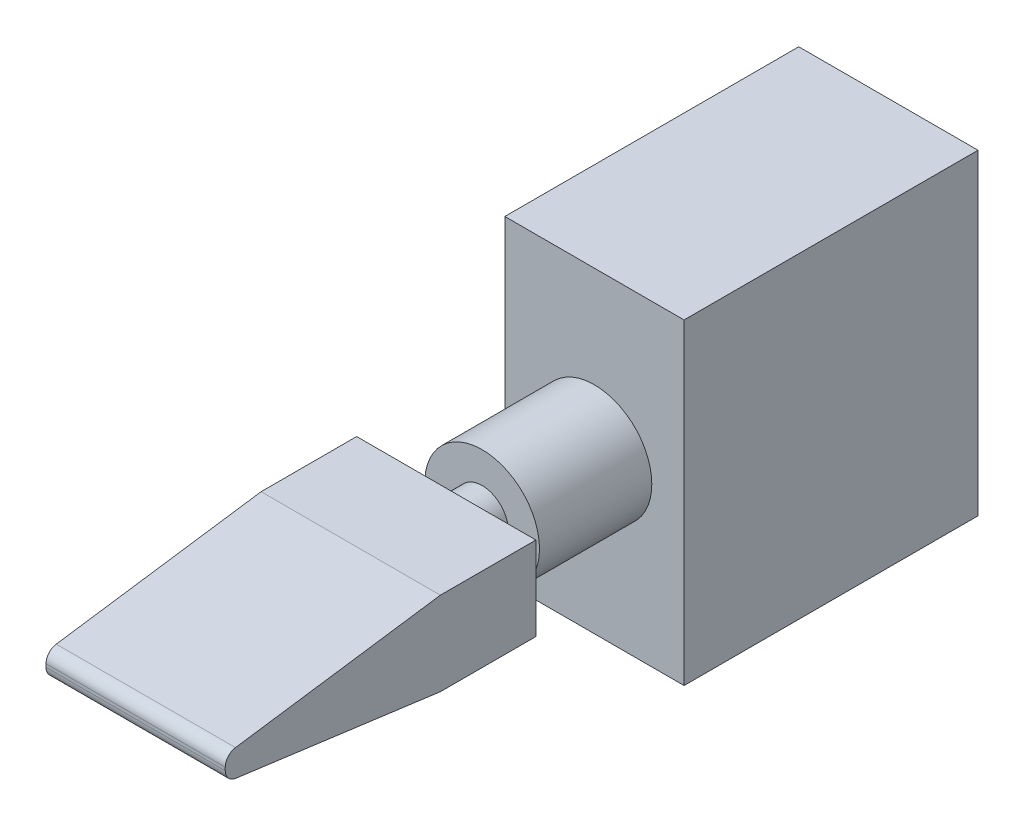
ISO-10303-21;
HEADER;
FILE_DESCRIPTION(('STEP AP214'),'2;1');
FILE_NAME('part.step','',(''),(''),'','','');
FILE_SCHEMA(('AUTOMOTIVE_DESIGN { 1 0 10303 214 1 1 1 1 }'));
ENDSEC;
DATA;
#1=APPLICATION_CONTEXT('core data for automotive mechanical design processes');
#2=APPLICATION_PROTOCOL_DEFINITION('international standard','automotive_design',2000,#1);
#3=PRODUCT_CONTEXT('',#1,'mechanical');
#4=PRODUCT('Part','Part','',(#3));
#5=PRODUCT_RELATED_PRODUCT_CATEGORY('part','',(#4));
#6=PRODUCT_DEFINITION_FORMATION('','',#4);
#7=PRODUCT_DEFINITION_CONTEXT('part definition',#1,'design');
#8=PRODUCT_DEFINITION('design','',#6,#7);
#9=PRODUCT_DEFINITION_SHAPE('','',#8);
#10=(LENGTH_UNIT() NAMED_UNIT(*) SI_UNIT(.MILLI.,.METRE.));
#11=(NAMED_UNIT(*) PLANE_ANGLE_UNIT() SI_UNIT($,.RADIAN.));
#12=(NAMED_UNIT(*) SI_UNIT($,.STERADIAN.) SOLID_ANGLE_UNIT());
#13=UNCERTAINTY_MEASURE_WITH_UNIT(LENGTH_MEASURE(1.E-05),#10,'distance_accuracy_value','');
#14=(GEOMETRIC_REPRESENTATION_CONTEXT(3) GLOBAL_UNCERTAINTY_ASSIGNED_CONTEXT((#13)) GLOBAL_UNIT_ASSIGNED_CONTEXT((#10,
#11,#12)) REPRESENTATION_CONTEXT('',''));
#15=CARTESIAN_POINT('',(0.,0.,0.));
#16=DIRECTION('',(0.,0.,1.));
#17=DIRECTION('',(1.,0.,0.));
#18=AXIS2_PLACEMENT_3D('',#15,#16,#17);
#19=CARTESIAN_POINT('',(9.525,-4.445,80.01));
#20=DIRECTION('',(-1.,0.,0.));
#21=DIRECTION('',(0.,0.,1.));
#22=AXIS2_PLACEMENT_3D('',#19,#20,#21);
#23=PLANE('',#22);
#24=DIRECTION('',(0.,0.,-1.));
#25=VECTOR('',#24,1.);
#26=CARTESIAN_POINT('',(9.525,4.445,80.01));
#27=LINE('',#26,#25);
#28=CARTESIAN_POINT('',(9.525,4.445,57.15));
#29=VERTEX_POINT('',#28);
#30=CARTESIAN_POINT('',(9.525,4.445,46.99));
#31=VERTEX_POINT('',#30);
#32=EDGE_CURVE('E175',#29,#31,#27,.T.);
#33=ORIENTED_EDGE('',*,*,#32,.F.);
#34=DIRECTION('',(0.,0.142868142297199,-0.989741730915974));
#35=VECTOR('',#34,1.);
#36=CARTESIAN_POINT('',(9.525,12.4354281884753,1.79504053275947));
#37=LINE('',#36,#35);
#38=CARTESIAN_POINT('',(9.525,1.30231595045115,78.9214425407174));
#39=VERTEX_POINT('',#38);
#40=EDGE_CURVE('E146',#39,#29,#37,.T.);
#41=ORIENTED_EDGE('',*,*,#40,.F.);
#42=CARTESIAN_POINT('',(9.525,0.04534395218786,78.74));
#43=DIRECTION('',(1.,0.,0.));
#44=DIRECTION('',(0.,0.,-1.));
#45=AXIS2_PLACEMENT_3D('',#42,#43,#44);
#46=CIRCLE('',#45,1.27);
#47=CARTESIAN_POINT('',(9.525,0.0453439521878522,80.01));
#48=VERTEX_POINT('',#47);
#49=EDGE_CURVE('E135',#48,#39,#46,.F.);
#50=ORIENTED_EDGE('',*,*,#49,.F.);
#51=DIRECTION('',(0.,1.,0.));
#52=VECTOR('',#51,1.);
#53=CARTESIAN_POINT('',(9.525,-4.445,80.01));
#54=LINE('',#53,#52);
#55=CARTESIAN_POINT('',(9.525,-0.28301559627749,80.01));
#56=VERTEX_POINT('',#55);
#57=EDGE_CURVE('E145',#56,#48,#54,.T.);
#58=ORIENTED_EDGE('',*,*,#57,.F.);
#59=CARTESIAN_POINT('',(9.525,-0.283015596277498,78.74));
#60=DIRECTION('',(1.,0.,0.));
#61=DIRECTION('',(0.,0.,-1.));
#62=AXIS2_PLACEMENT_3D('',#59,#60,#61);
#63=CIRCLE('',#62,1.27);
#64=CARTESIAN_POINT('',(9.525,-1.54185927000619,78.9079660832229));
#65=VERTEX_POINT('',#64);
#66=EDGE_CURVE('E68',#56,#65,#63,.T.);
#67=ORIENTED_EDGE('',*,*,#66,.T.);
#68=DIRECTION('',(0.,0.132256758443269,0.991215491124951));
#69=VECTOR('',#68,1.);
#70=CARTESIAN_POINT('',(9.525,-11.8593249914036,1.58237627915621));
#71=LINE('',#70,#69);
#72=CARTESIAN_POINT('',(9.525,-4.445,57.15));
#73=VERTEX_POINT('',#72);
#74=EDGE_CURVE('E435',#73,#65,#71,.T.);
#75=ORIENTED_EDGE('',*,*,#74,.F.);
#76=DIRECTION('',(0.,0.,-1.));
#77=VECTOR('',#76,1.);
#78=CARTESIAN_POINT('',(9.525,-4.445,80.01));
#79=LINE('',#78,#77);
#80=CARTESIAN_POINT('',(9.525,-4.445,46.99));
#81=VERTEX_POINT('',#80);
#82=EDGE_CURVE('E153',#73,#81,#79,.T.);
#83=ORIENTED_EDGE('',*,*,#82,.T.);
#84=DIRECTION('',(0.,1.,0.));
#85=VECTOR('',#84,1.);
#86=CARTESIAN_POINT('',(9.525,-4.445,46.99));
#87=LINE('',#86,#85);
#88=EDGE_CURVE('E162',#81,#31,#87,.T.);
#89=ORIENTED_EDGE('',*,*,#88,.T.);
#90=EDGE_LOOP('',(#33,#41,#50,#58,#67,#75,#83,#89));
#91=FACE_BOUND('',#90,.T.);
#92=ADVANCED_FACE('F45',(#91),#23,.F.);
#93=CARTESIAN_POINT('',(-9.525,-4.445,80.01));
#94=DIRECTION('',(1.,0.,0.));
#95=DIRECTION('',(0.,0.,-1.));
#96=AXIS2_PLACEMENT_3D('',#93,#94,#95);
#97=PLANE('',#96);
#98=CARTESIAN_POINT('',(-9.525,0.04534395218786,78.74));
#99=DIRECTION('',(1.,0.,0.));
#100=DIRECTION('',(0.,0.,-1.));
#101=AXIS2_PLACEMENT_3D('',#98,#99,#100);
#102=CIRCLE('',#101,1.27);
#103=CARTESIAN_POINT('',(-9.525,0.0453439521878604,80.01));
#104=VERTEX_POINT('',#103);
#105=CARTESIAN_POINT('',(-9.525,1.30231595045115,78.9214425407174));
#106=VERTEX_POINT('',#105);
#107=EDGE_CURVE('E60',#104,#106,#102,.F.);
#108=ORIENTED_EDGE('',*,*,#107,.T.);
#109=DIRECTION('',(0.,0.142868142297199,-0.989741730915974));
#110=VECTOR('',#109,1.);
#111=CARTESIAN_POINT('',(-9.525,1.03108091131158,80.8004663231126));
#112=LINE('',#111,#110);
#113=CARTESIAN_POINT('',(-9.525,4.445,57.15));
#114=VERTEX_POINT('',#113);
#115=EDGE_CURVE('E11',#106,#114,#112,.T.);
#116=ORIENTED_EDGE('',*,*,#115,.T.);
#117=DIRECTION('',(0.,0.,-1.));
#118=VECTOR('',#117,1.);
#119=CARTESIAN_POINT('',(-9.525,4.445,80.01));
#120=LINE('',#119,#118);
#121=CARTESIAN_POINT('',(-9.525,4.445,46.99));
#122=VERTEX_POINT('',#121);
#123=EDGE_CURVE('E173',#114,#122,#120,.T.);
#124=ORIENTED_EDGE('',*,*,#123,.T.);
#125=DIRECTION('',(0.,-1.,0.));
#126=VECTOR('',#125,1.);
#127=CARTESIAN_POINT('',(-9.525,-4.445,46.99));
#128=LINE('',#127,#126);
#129=CARTESIAN_POINT('',(-9.525,-4.445,46.99));
#130=VERTEX_POINT('',#129);
#131=EDGE_CURVE('E156',#122,#130,#128,.T.);
#132=ORIENTED_EDGE('',*,*,#131,.T.);
#133=DIRECTION('',(0.,0.,-1.));
#134=VECTOR('',#133,1.);
#135=CARTESIAN_POINT('',(-9.525,-4.445,80.01));
#136=LINE('',#135,#134);
#137=CARTESIAN_POINT('',(-9.525,-4.445,57.15));
#138=VERTEX_POINT('',#137);
#139=EDGE_CURVE('E171',#138,#130,#136,.T.);
#140=ORIENTED_EDGE('',*,*,#139,.F.);
#141=DIRECTION('',(0.,0.132256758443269,0.991215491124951));
#142=VECTOR('',#141,1.);
#143=CARTESIAN_POINT('',(-9.525,-1.44816949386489,79.6101363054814));
#144=LINE('',#143,#142);
#145=CARTESIAN_POINT('',(-9.525,-1.54185927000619,78.9079660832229));
#146=VERTEX_POINT('',#145);
#147=EDGE_CURVE('E159',#138,#146,#144,.T.);
#148=ORIENTED_EDGE('',*,*,#147,.T.);
#149=CARTESIAN_POINT('',(-9.525,-0.283015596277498,78.74));
#150=DIRECTION('',(1.,0.,0.));
#151=DIRECTION('',(0.,0.,-1.));
#152=AXIS2_PLACEMENT_3D('',#149,#150,#151);
#153=CIRCLE('',#152,1.27);
#154=CARTESIAN_POINT('',(-9.525,-0.28301559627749,80.01));
#155=VERTEX_POINT('',#154);
#156=EDGE_CURVE('E430',#155,#146,#153,.T.);
#157=ORIENTED_EDGE('',*,*,#156,.F.);
#158=DIRECTION('',(0.,-1.,0.));
#159=VECTOR('',#158,1.);
#160=CARTESIAN_POINT('',(-9.525,-4.445,80.01));
#161=LINE('',#160,#159);
#162=EDGE_CURVE('E150',#104,#155,#161,.T.);
#163=ORIENTED_EDGE('',*,*,#162,.F.);
#164=EDGE_LOOP('',(#108,#116,#124,#132,#140,#148,#157,#163));
#165=FACE_BOUND('',#164,.T.);
#166=ADVANCED_FACE('F254',(#165),#97,.F.);
#167=CARTESIAN_POINT('',(9.525,-16.8275,31.242));
#168=DIRECTION('',(-1.,0.,0.));
#169=DIRECTION('',(0.,0.,1.));
#170=AXIS2_PLACEMENT_3D('',#167,#168,#169);
#171=PLANE('',#170);
#172=DIRECTION('',(0.,1.,0.));
#173=VECTOR('',#172,1.);
#174=CARTESIAN_POINT('',(9.525,-16.8275,0.));
#175=LINE('',#174,#173);
#176=CARTESIAN_POINT('',(9.525,-16.8275,0.));
#177=VERTEX_POINT('',#176);
#178=CARTESIAN_POINT('',(9.525,16.8275,0.));
#179=VERTEX_POINT('',#178);
#180=EDGE_CURVE('E187',#177,#179,#175,.T.);
#181=ORIENTED_EDGE('',*,*,#180,.T.);
#182=DIRECTION('',(0.,0.,-1.));
#183=VECTOR('',#182,1.);
#184=CARTESIAN_POINT('',(9.525,16.8275,31.242));
#185=LINE('',#184,#183);
#186=CARTESIAN_POINT('',(9.525,16.8275,31.242));
#187=VERTEX_POINT('',#186);
#188=EDGE_CURVE('E190',#187,#179,#185,.T.);
#189=ORIENTED_EDGE('',*,*,#188,.F.);
#190=DIRECTION('',(0.,1.,0.));
#191=VECTOR('',#190,1.);
#192=CARTESIAN_POINT('',(9.525,-16.8275,31.242));
#193=LINE('',#192,#191);
#194=CARTESIAN_POINT('',(9.525,-16.8275,31.242));
#195=VERTEX_POINT('',#194);
#196=EDGE_CURVE('E191',#195,#187,#193,.T.);
#197=ORIENTED_EDGE('',*,*,#196,.F.);
#198=DIRECTION('',(0.,0.,-1.));
#199=VECTOR('',#198,1.);
#200=CARTESIAN_POINT('',(9.525,-16.8275,31.242));
#201=LINE('',#200,#199);
#202=EDGE_CURVE('E201',#195,#177,#201,.T.);
#203=ORIENTED_EDGE('',*,*,#202,.T.);
#204=EDGE_LOOP('',(#181,#189,#197,#203));
#205=FACE_BOUND('',#204,.T.);
#206=ADVANCED_FACE('F47',(#205),#171,.F.);
#207=CARTESIAN_POINT('',(-9.525,16.8275,31.242));
#208=DIRECTION('',(0.,-1.,0.));
#209=DIRECTION('',(0.,0.,-1.));
#210=AXIS2_PLACEMENT_3D('',#207,#208,#209);
#211=PLANE('',#210);
#212=DIRECTION('',(-1.,0.,0.));
#213=VECTOR('',#212,1.);
#214=CARTESIAN_POINT('',(-9.525,16.8275,0.));
#215=LINE('',#214,#213);
#216=CARTESIAN_POINT('',(-9.525,16.8275,0.));
#217=VERTEX_POINT('',#216);
#218=EDGE_CURVE('E204',#179,#217,#215,.T.);
#219=ORIENTED_EDGE('',*,*,#218,.T.);
#220=DIRECTION('',(0.,0.,-1.));
#221=VECTOR('',#220,1.);
#222=CARTESIAN_POINT('',(-9.525,16.8275,31.242));
#223=LINE('',#222,#221);
#224=CARTESIAN_POINT('',(-9.525,16.8275,31.242));
#225=VERTEX_POINT('',#224);
#226=EDGE_CURVE('E214',#225,#217,#223,.T.);
#227=ORIENTED_EDGE('',*,*,#226,.F.);
#228=DIRECTION('',(-1.,0.,0.));
#229=VECTOR('',#228,1.);
#230=CARTESIAN_POINT('',(-9.525,16.8275,31.242));
#231=LINE('',#230,#229);
#232=EDGE_CURVE('E194',#187,#225,#231,.T.);
#233=ORIENTED_EDGE('',*,*,#232,.F.);
#234=ORIENTED_EDGE('',*,*,#188,.T.);
#235=EDGE_LOOP('',(#219,#227,#233,#234));
#236=FACE_BOUND('',#235,.T.);
#237=ADVANCED_FACE('F221',(#236),#211,.F.);
#238=CARTESIAN_POINT('',(-9.525,-16.8275,31.242));
#239=DIRECTION('',(1.,0.,0.));
#240=DIRECTION('',(0.,0.,-1.));
#241=AXIS2_PLACEMENT_3D('',#238,#239,#240);
#242=PLANE('',#241);
#243=DIRECTION('',(0.,-1.,0.));
#244=VECTOR('',#243,1.);
#245=CARTESIAN_POINT('',(-9.525,-16.8275,0.));
#246=LINE('',#245,#244);
#247=CARTESIAN_POINT('',(-9.525,-16.8275,0.));
#248=VERTEX_POINT('',#247);
#249=EDGE_CURVE('E206',#217,#248,#246,.T.);
#250=ORIENTED_EDGE('',*,*,#249,.T.);
#251=DIRECTION('',(0.,0.,-1.));
#252=VECTOR('',#251,1.);
#253=CARTESIAN_POINT('',(-9.525,-16.8275,31.242));
#254=LINE('',#253,#252);
#255=CARTESIAN_POINT('',(-9.525,-16.8275,31.242));
#256=VERTEX_POINT('',#255);
#257=EDGE_CURVE('E211',#256,#248,#254,.T.);
#258=ORIENTED_EDGE('',*,*,#257,.F.);
#259=DIRECTION('',(0.,-1.,0.));
#260=VECTOR('',#259,1.);
#261=CARTESIAN_POINT('',(-9.525,-16.8275,31.242));
#262=LINE('',#261,#260);
#263=EDGE_CURVE('E197',#225,#256,#262,.T.);
#264=ORIENTED_EDGE('',*,*,#263,.F.);
#265=ORIENTED_EDGE('',*,*,#226,.T.);
#266=EDGE_LOOP('',(#250,#258,#264,#265));
#267=FACE_BOUND('',#266,.T.);
#268=ADVANCED_FACE('F233',(#267),#242,.F.);
#269=CARTESIAN_POINT('',(-9.525,-16.8275,31.242));
#270=DIRECTION('',(0.,1.,0.));
#271=DIRECTION('',(0.,0.,1.));
#272=AXIS2_PLACEMENT_3D('',#269,#270,#271);
#273=PLANE('',#272);
#274=DIRECTION('',(1.,0.,0.));
#275=VECTOR('',#274,1.);
#276=CARTESIAN_POINT('',(-9.525,-16.8275,0.));
#277=LINE('',#276,#275);
#278=EDGE_CURVE('E195',#248,#177,#277,.T.);
#279=ORIENTED_EDGE('',*,*,#278,.T.);
#280=ORIENTED_EDGE('',*,*,#202,.F.);
#281=DIRECTION('',(1.,0.,0.));
#282=VECTOR('',#281,1.);
#283=CARTESIAN_POINT('',(-9.525,-16.8275,31.242));
#284=LINE('',#283,#282);
#285=EDGE_CURVE('E199',#256,#195,#284,.T.);
#286=ORIENTED_EDGE('',*,*,#285,.F.);
#287=ORIENTED_EDGE('',*,*,#257,.T.);
#288=EDGE_LOOP('',(#279,#280,#286,#287));
#289=FACE_BOUND('',#288,.T.);
#290=ADVANCED_FACE('F237',(#289),#273,.F.);
#291=CARTESIAN_POINT('',(0.,0.,31.242));
#292=DIRECTION('',(0.,0.,-1.));
#293=DIRECTION('',(-1.,0.,0.));
#294=AXIS2_PLACEMENT_3D('',#291,#292,#293);
#295=PLANE('',#294);
#296=CARTESIAN_POINT('',(0.,0.,31.242));
#297=DIRECTION('',(0.,0.,1.));
#298=DIRECTION('',(1.,0.,0.));
#299=AXIS2_PLACEMENT_3D('',#296,#297,#298);
#300=CIRCLE('',#299,6.096);
#301=CARTESIAN_POINT('',(6.096,0.,31.242));
#302=VERTEX_POINT('',#301);
#303=EDGE_CURVE('E184',#302,#302,#300,.T.);
#304=ORIENTED_EDGE('',*,*,#303,.F.);
#305=EDGE_LOOP('',(#304));
#306=FACE_BOUND('',#305,.T.);
#307=ORIENTED_EDGE('',*,*,#196,.T.);
#308=ORIENTED_EDGE('',*,*,#232,.T.);
#309=ORIENTED_EDGE('',*,*,#263,.T.);
#310=ORIENTED_EDGE('',*,*,#285,.T.);
#311=EDGE_LOOP('',(#307,#308,#309,#310));
#312=FACE_BOUND('',#311,.T.);
#313=ADVANCED_FACE('F239',(#306,#312),#295,.F.);
#314=CARTESIAN_POINT('',(0.,0.,0.));
#315=DIRECTION('',(0.,0.,-1.));
#316=DIRECTION('',(-1.,0.,0.));
#317=AXIS2_PLACEMENT_3D('',#314,#315,#316);
#318=PLANE('',#317);
#319=ORIENTED_EDGE('',*,*,#180,.F.);
#320=ORIENTED_EDGE('',*,*,#278,.F.);
#321=ORIENTED_EDGE('',*,*,#249,.F.);
#322=ORIENTED_EDGE('',*,*,#218,.F.);
#323=EDGE_LOOP('',(#319,#320,#321,#322));
#324=FACE_BOUND('',#323,.T.);
#325=ADVANCED_FACE('F229',(#324),#318,.T.);
#326=CARTESIAN_POINT('',(0.,0.,43.18));
#327=DIRECTION('',(0.,0.,-1.));
#328=DIRECTION('',(-1.,0.,0.));
#329=AXIS2_PLACEMENT_3D('',#326,#327,#328);
#330=CYLINDRICAL_SURFACE('',#329,6.096);
#331=CARTESIAN_POINT('',(0.,0.,43.18));
#332=DIRECTION('',(0.,0.,1.));
#333=DIRECTION('',(1.,0.,0.));
#334=AXIS2_PLACEMENT_3D('',#331,#332,#333);
#335=CIRCLE('',#334,6.096);
#336=CARTESIAN_POINT('',(6.096,0.,43.18));
#337=VERTEX_POINT('',#336);
#338=EDGE_CURVE('E180',#337,#337,#335,.T.);
#339=ORIENTED_EDGE('',*,*,#338,.F.);
#340=EDGE_LOOP('',(#339));
#341=FACE_BOUND('',#340,.T.);
#342=ORIENTED_EDGE('',*,*,#303,.T.);
#343=EDGE_LOOP('',(#342));
#344=FACE_BOUND('',#343,.T.);
#345=ADVANCED_FACE('F247',(#341,#344),#330,.T.);
#346=CARTESIAN_POINT('',(0.,0.,43.18));
#347=DIRECTION('',(0.,0.,1.));
#348=DIRECTION('',(1.,0.,0.));
#349=AXIS2_PLACEMENT_3D('',#346,#347,#348);
#350=PLANE('',#349);
#351=CARTESIAN_POINT('',(0.,0.,43.18));
#352=DIRECTION('',(0.,0.,1.));
#353=DIRECTION('',(1.,0.,0.));
#354=AXIS2_PLACEMENT_3D('',#351,#352,#353);
#355=CIRCLE('',#354,2.794);
#356=CARTESIAN_POINT('',(-2.794,0.,43.18));
#357=VERTEX_POINT('',#356);
#358=EDGE_CURVE('E181',#357,#357,#355,.T.);
#359=ORIENTED_EDGE('',*,*,#358,.F.);
#360=EDGE_LOOP('',(#359));
#361=FACE_BOUND('',#360,.T.);
#362=ORIENTED_EDGE('',*,*,#338,.T.);
#363=EDGE_LOOP('',(#362));
#364=FACE_BOUND('',#363,.T.);
#365=ADVANCED_FACE('F267',(#361,#364),#350,.T.);
#366=CARTESIAN_POINT('',(0.,0.,46.99));
#367=DIRECTION('',(0.,0.,-1.));
#368=DIRECTION('',(-1.,0.,0.));
#369=AXIS2_PLACEMENT_3D('',#366,#367,#368);
#370=CYLINDRICAL_SURFACE('',#369,2.794);
#371=CARTESIAN_POINT('',(0.,0.,46.99));
#372=DIRECTION('',(0.,0.,1.));
#373=DIRECTION('',(1.,0.,0.));
#374=AXIS2_PLACEMENT_3D('',#371,#372,#373);
#375=CIRCLE('',#374,2.794);
#376=CARTESIAN_POINT('',(-2.794,0.,46.99));
#377=VERTEX_POINT('',#376);
#378=EDGE_CURVE('E177',#377,#377,#375,.T.);
#379=CARTESIAN_POINT('',(-2.794,0.,46.99));
#380=CARTESIAN_POINT('',(-2.794,0.,46.9503125));
#381=CARTESIAN_POINT('',(-2.794,0.,46.910625));
#382=CARTESIAN_POINT('',(-2.794,0.,46.83125));
#383=CARTESIAN_POINT('',(-2.794,0.,46.7915625));
#384=CARTESIAN_POINT('',(-2.794,0.,46.7121875));
#385=CARTESIAN_POINT('',(-2.794,0.,46.6725));
#386=CARTESIAN_POINT('',(-2.794,0.,46.593125));
#387=CARTESIAN_POINT('',(-2.794,0.,46.5534375));
#388=CARTESIAN_POINT('',(-2.794,0.,46.4740625));
#389=CARTESIAN_POINT('',(-2.794,0.,46.434375));
#390=CARTESIAN_POINT('',(-2.794,0.,46.355));
#391=CARTESIAN_POINT('',(-2.794,0.,46.3153125));
#392=CARTESIAN_POINT('',(-2.794,0.,46.2359375));
#393=CARTESIAN_POINT('',(-2.794,0.,46.19625));
#394=CARTESIAN_POINT('',(-2.794,0.,46.116875));
#395=CARTESIAN_POINT('',(-2.794,0.,46.0771875));
#396=CARTESIAN_POINT('',(-2.794,0.,45.9978125));
#397=CARTESIAN_POINT('',(-2.794,0.,45.958125));
#398=CARTESIAN_POINT('',(-2.794,0.,45.87875));
#399=CARTESIAN_POINT('',(-2.794,0.,45.8390625));
#400=CARTESIAN_POINT('',(-2.794,0.,45.7596875));
#401=CARTESIAN_POINT('',(-2.794,0.,45.72));
#402=CARTESIAN_POINT('',(-2.794,0.,45.640625));
#403=CARTESIAN_POINT('',(-2.794,0.,45.6009375));
#404=CARTESIAN_POINT('',(-2.794,0.,45.5215625));
#405=CARTESIAN_POINT('',(-2.794,0.,45.481875));
#406=CARTESIAN_POINT('',(-2.794,0.,45.4025));
#407=CARTESIAN_POINT('',(-2.794,0.,45.3628125));
#408=CARTESIAN_POINT('',(-2.794,0.,45.2834375));
#409=CARTESIAN_POINT('',(-2.794,0.,45.24375));
#410=CARTESIAN_POINT('',(-2.794,0.,45.164375));
#411=CARTESIAN_POINT('',(-2.794,0.,45.1246875));
#412=CARTESIAN_POINT('',(-2.794,0.,45.0453125));
#413=CARTESIAN_POINT('',(-2.794,0.,45.005625));
#414=CARTESIAN_POINT('',(-2.794,0.,44.92625));
#415=CARTESIAN_POINT('',(-2.794,0.,44.8865625));
#416=CARTESIAN_POINT('',(-2.794,0.,44.8071875));
#417=CARTESIAN_POINT('',(-2.794,0.,44.7675));
#418=CARTESIAN_POINT('',(-2.794,0.,44.688125));
#419=CARTESIAN_POINT('',(-2.794,0.,44.6484375));
#420=CARTESIAN_POINT('',(-2.794,0.,44.5690625));
#421=CARTESIAN_POINT('',(-2.794,0.,44.529375));
#422=CARTESIAN_POINT('',(-2.794,0.,44.45));
#423=CARTESIAN_POINT('',(-2.794,0.,44.4103125));
#424=CARTESIAN_POINT('',(-2.794,0.,44.3309375));
#425=CARTESIAN_POINT('',(-2.794,0.,44.29125));
#426=CARTESIAN_POINT('',(-2.794,0.,44.211875));
#427=CARTESIAN_POINT('',(-2.794,0.,44.1721875));
#428=CARTESIAN_POINT('',(-2.794,0.,44.0928125));
#429=CARTESIAN_POINT('',(-2.794,0.,44.053125));
#430=CARTESIAN_POINT('',(-2.794,0.,43.97375));
#431=CARTESIAN_POINT('',(-2.794,0.,43.9340625));
#432=CARTESIAN_POINT('',(-2.794,0.,43.8546875));
#433=CARTESIAN_POINT('',(-2.794,0.,43.815));
#434=CARTESIAN_POINT('',(-2.794,0.,43.735625));
#435=CARTESIAN_POINT('',(-2.794,0.,43.6959375));
#436=CARTESIAN_POINT('',(-2.794,0.,43.6165625));
#437=CARTESIAN_POINT('',(-2.794,0.,43.576875));
#438=CARTESIAN_POINT('',(-2.794,0.,43.4975));
#439=CARTESIAN_POINT('',(-2.794,0.,43.4578125));
#440=CARTESIAN_POINT('',(-2.794,0.,43.3784375));
#441=CARTESIAN_POINT('',(-2.794,0.,43.33875));
#442=CARTESIAN_POINT('',(-2.794,0.,43.259375));
#443=CARTESIAN_POINT('',(-2.794,0.,43.2196875));
#444=CARTESIAN_POINT('',(-2.794,0.,43.18));
#445=B_SPLINE_CURVE_WITH_KNOTS('',3,(#379,#380,#381,#382,#383,#384,#385,#386,#387,#388,#389,
#390,#391,#392,#393,#394,#395,#396,#397,#398,#399,#400,#401,#402,#403,#404,#405,#406,#407,#408,
#409,#410,#411,#412,#413,#414,#415,#416,#417,#418,#419,#420,#421,#422,#423,#424,#425,#426,#427,
#428,#429,#430,#431,#432,#433,#434,#435,#436,#437,#438,#439,#440,#441,#442,#443,#444),
.UNSPECIFIED.,.F.,.F.,(4,2,2,2,2,2,2,2,2,2,2,2,2,2,2,2,2,2,2,2,2,2,2,2,2,2,2,2,2,2,2,2,4),(0.,
0.119062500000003,0.238125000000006,0.357187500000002,0.476250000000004,0.5953125,
0.714375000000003,0.833437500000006,0.952500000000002,1.0715625,1.190625,1.3096875,
1.42875000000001,1.5478125,1.66687500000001,1.7859375,1.905,2.02406250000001,2.143125,
2.26218750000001,2.38125,2.5003125,2.61937500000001,2.7384375,2.85750000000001,2.9765625,
3.095625,3.21468750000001,3.33375,3.45281250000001,3.571875,3.6909375,3.81000000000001),.UNSPECIFIED.);
#446=EDGE_CURVE('BSEAM264',#377,#357,#445,.T.);
#447=ORIENTED_EDGE('',*,*,#378,.F.);
#448=ORIENTED_EDGE('',*,*,#358,.T.);
#449=ORIENTED_EDGE('',*,*,#446,.T.);
#450=ORIENTED_EDGE('',*,*,#446,.F.);
#451=EDGE_LOOP('',(#447,#449,#448,#450));
#452=FACE_BOUND('',#451,.T.);
#453=ADVANCED_FACE('F264',(#452),#370,.T.);
#454=CARTESIAN_POINT('',(-9.525,4.445,80.01));
#455=DIRECTION('',(0.,-1.,0.));
#456=DIRECTION('',(0.,0.,-1.));
#457=AXIS2_PLACEMENT_3D('',#454,#455,#456);
#458=PLANE('',#457);
#459=ORIENTED_EDGE('',*,*,#123,.F.);
#460=DIRECTION('',(1.,0.,0.));
#461=VECTOR('',#460,1.);
#462=CARTESIAN_POINT('',(-23.495,4.445,57.15));
#463=LINE('',#462,#461);
#464=EDGE_CURVE('E428',#114,#29,#463,.T.);
#465=ORIENTED_EDGE('',*,*,#464,.T.);
#466=ORIENTED_EDGE('',*,*,#32,.T.);
#467=DIRECTION('',(-1.,0.,0.));
#468=VECTOR('',#467,1.);
#469=CARTESIAN_POINT('',(-9.525,4.445,46.99));
#470=LINE('',#469,#468);
#471=EDGE_CURVE('E165',#31,#122,#470,.T.);
#472=ORIENTED_EDGE('',*,*,#471,.T.);
#473=EDGE_LOOP('',(#459,#465,#466,#472));
#474=FACE_BOUND('',#473,.T.);
#475=ADVANCED_FACE('F263',(#474),#458,.F.);
#476=CARTESIAN_POINT('',(-9.525,-4.445,80.01));
#477=DIRECTION('',(0.,1.,0.));
#478=DIRECTION('',(0.,0.,1.));
#479=AXIS2_PLACEMENT_3D('',#476,#477,#478);
#480=PLANE('',#479);
#481=ORIENTED_EDGE('',*,*,#82,.F.);
#482=DIRECTION('',(1.,0.,0.));
#483=VECTOR('',#482,1.);
#484=CARTESIAN_POINT('',(-23.495,-4.445,57.15));
#485=LINE('',#484,#483);
#486=EDGE_CURVE('E438',#138,#73,#485,.T.);
#487=ORIENTED_EDGE('',*,*,#486,.F.);
#488=ORIENTED_EDGE('',*,*,#139,.T.);
#489=DIRECTION('',(1.,0.,0.));
#490=VECTOR('',#489,1.);
#491=CARTESIAN_POINT('',(-9.525,-4.445,46.99));
#492=LINE('',#491,#490);
#493=EDGE_CURVE('E151',#130,#81,#492,.T.);
#494=ORIENTED_EDGE('',*,*,#493,.T.);
#495=EDGE_LOOP('',(#481,#487,#488,#494));
#496=FACE_BOUND('',#495,.T.);
#497=ADVANCED_FACE('F331',(#496),#480,.F.);
#498=CARTESIAN_POINT('',(0.,0.,80.01));
#499=DIRECTION('',(0.,0.,-1.));
#500=DIRECTION('',(-1.,0.,0.));
#501=AXIS2_PLACEMENT_3D('',#498,#499,#500);
#502=PLANE('',#501);
#503=ORIENTED_EDGE('',*,*,#57,.T.);
#504=DIRECTION('',(1.,0.,0.));
#505=VECTOR('',#504,1.);
#506=CARTESIAN_POINT('',(-23.495,0.04534395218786,80.01));
#507=LINE('',#506,#505);
#508=EDGE_CURVE('E53',#48,#104,#507,.F.);
#509=ORIENTED_EDGE('',*,*,#508,.T.);
#510=ORIENTED_EDGE('',*,*,#162,.T.);
#511=DIRECTION('',(1.,0.,0.));
#512=VECTOR('',#511,1.);
#513=CARTESIAN_POINT('',(-23.495,-0.283015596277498,80.01));
#514=LINE('',#513,#512);
#515=EDGE_CURVE('E141',#155,#56,#514,.T.);
#516=ORIENTED_EDGE('',*,*,#515,.T.);
#517=EDGE_LOOP('',(#503,#509,#510,#516));
#518=FACE_BOUND('',#517,.T.);
#519=ADVANCED_FACE('F149',(#518),#502,.F.);
#520=CARTESIAN_POINT('',(0.,0.,46.99));
#521=DIRECTION('',(0.,0.,-1.));
#522=DIRECTION('',(-1.,0.,0.));
#523=AXIS2_PLACEMENT_3D('',#520,#521,#522);
#524=PLANE('',#523);
#525=ORIENTED_EDGE('',*,*,#378,.T.);
#526=EDGE_LOOP('',(#525));
#527=FACE_BOUND('',#526,.T.);
#528=ORIENTED_EDGE('',*,*,#88,.F.);
#529=ORIENTED_EDGE('',*,*,#493,.F.);
#530=ORIENTED_EDGE('',*,*,#131,.F.);
#531=ORIENTED_EDGE('',*,*,#471,.F.);
#532=EDGE_LOOP('',(#528,#529,#530,#531));
#533=FACE_BOUND('',#532,.T.);
#534=ADVANCED_FACE('F293',(#527,#533),#524,.T.);
#535=CARTESIAN_POINT('',(-23.495,-11.8593249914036,1.58237627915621));
#536=DIRECTION('',(0.,0.991215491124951,-0.132256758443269));
#537=DIRECTION('',(0.,0.132256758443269,0.991215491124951));
#538=AXIS2_PLACEMENT_3D('',#535,#536,#537);
#539=PLANE('',#538);
#540=ORIENTED_EDGE('',*,*,#486,.T.);
#541=ORIENTED_EDGE('',*,*,#74,.T.);
#542=DIRECTION('',(1.,0.,0.));
#543=VECTOR('',#542,1.);
#544=CARTESIAN_POINT('',(-23.495,-1.54185927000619,78.9079660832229));
#545=LINE('',#544,#543);
#546=EDGE_CURVE('E147',#146,#65,#545,.T.);
#547=ORIENTED_EDGE('',*,*,#546,.F.);
#548=ORIENTED_EDGE('',*,*,#147,.F.);
#549=EDGE_LOOP('',(#540,#541,#547,#548));
#550=FACE_BOUND('',#549,.T.);
#551=ADVANCED_FACE('F299',(#550),#539,.F.);
#552=CARTESIAN_POINT('',(-23.495,-0.283015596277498,78.74));
#553=DIRECTION('',(1.,0.,0.));
#554=DIRECTION('',(0.,0.,-1.));
#555=AXIS2_PLACEMENT_3D('',#552,#553,#554);
#556=CYLINDRICAL_SURFACE('',#555,1.27);
#557=ORIENTED_EDGE('',*,*,#156,.T.);
#558=ORIENTED_EDGE('',*,*,#546,.T.);
#559=ORIENTED_EDGE('',*,*,#66,.F.);
#560=ORIENTED_EDGE('',*,*,#515,.F.);
#561=EDGE_LOOP('',(#557,#558,#559,#560));
#562=FACE_BOUND('',#561,.T.);
#563=ADVANCED_FACE('F365',(#562),#556,.T.);
#564=CARTESIAN_POINT('',(-23.495,12.4354281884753,1.79504053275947));
#565=DIRECTION('',(0.,-0.989741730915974,-0.142868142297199));
#566=DIRECTION('',(0.,0.142868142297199,-0.989741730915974));
#567=AXIS2_PLACEMENT_3D('',#564,#565,#566);
#568=PLANE('',#567);
#569=DIRECTION('',(1.,0.,0.));
#570=VECTOR('',#569,1.);
#571=CARTESIAN_POINT('',(-23.495,1.30231595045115,78.9214425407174));
#572=LINE('',#571,#570);
#573=EDGE_CURVE('E426',#106,#39,#572,.T.);
#574=ORIENTED_EDGE('',*,*,#573,.T.);
#575=ORIENTED_EDGE('',*,*,#40,.T.);
#576=ORIENTED_EDGE('',*,*,#464,.F.);
#577=ORIENTED_EDGE('',*,*,#115,.F.);
#578=EDGE_LOOP('',(#574,#575,#576,#577));
#579=FACE_BOUND('',#578,.T.);
#580=ADVANCED_FACE('F376',(#579),#568,.F.);
#581=CARTESIAN_POINT('',(-23.495,0.04534395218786,78.74));
#582=DIRECTION('',(1.,0.,0.));
#583=DIRECTION('',(0.,0.,-1.));
#584=AXIS2_PLACEMENT_3D('',#581,#582,#583);
#585=CYLINDRICAL_SURFACE('',#584,1.27);
#586=ORIENTED_EDGE('',*,*,#508,.F.);
#587=ORIENTED_EDGE('',*,*,#49,.T.);
#588=ORIENTED_EDGE('',*,*,#573,.F.);
#589=ORIENTED_EDGE('',*,*,#107,.F.);
#590=EDGE_LOOP('',(#586,#587,#588,#589));
#591=FACE_BOUND('',#590,.T.);
#592=ADVANCED_FACE('F134',(#591),#585,.T.);
#593=CLOSED_SHELL('',(#92,#166,#206,#237,#268,#290,#313,#325,#345,#365,#453,#475,#497,#519,#534,
#551,#563,#580,#592));
#594=MANIFOLD_SOLID_BREP('B2',#593);
#595=ADVANCED_BREP_SHAPE_REPRESENTATION('',(#18,#594),#14);
#596=SHAPE_DEFINITION_REPRESENTATION(#9,#595);
ENDSEC;
END-ISO-10303-21;
